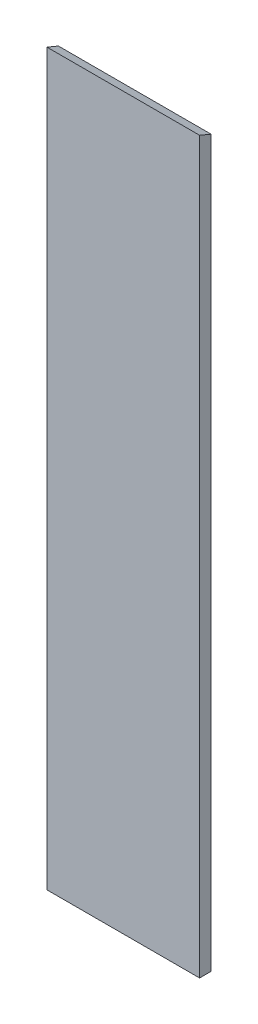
ISO-10303-21;
HEADER;
FILE_DESCRIPTION(('STEP AP214'),'2;1');
FILE_NAME('part.step','',(''),(''),'','','');
FILE_SCHEMA(('AUTOMOTIVE_DESIGN { 1 0 10303 214 1 1 1 1 }'));
ENDSEC;
DATA;
#1=APPLICATION_CONTEXT('core data for automotive mechanical design processes');
#2=APPLICATION_PROTOCOL_DEFINITION('international standard','automotive_design',2000,#1);
#3=PRODUCT_CONTEXT('',#1,'mechanical');
#4=PRODUCT('Part','Part','',(#3));
#5=PRODUCT_RELATED_PRODUCT_CATEGORY('part','',(#4));
#6=PRODUCT_DEFINITION_FORMATION('','',#4);
#7=PRODUCT_DEFINITION_CONTEXT('part definition',#1,'design');
#8=PRODUCT_DEFINITION('design','',#6,#7);
#9=PRODUCT_DEFINITION_SHAPE('','',#8);
#10=(LENGTH_UNIT() NAMED_UNIT(*) SI_UNIT(.MILLI.,.METRE.));
#11=(NAMED_UNIT(*) PLANE_ANGLE_UNIT() SI_UNIT($,.RADIAN.));
#12=(NAMED_UNIT(*) SI_UNIT($,.STERADIAN.) SOLID_ANGLE_UNIT());
#13=UNCERTAINTY_MEASURE_WITH_UNIT(LENGTH_MEASURE(1.E-05),#10,'distance_accuracy_value','');
#14=(GEOMETRIC_REPRESENTATION_CONTEXT(3) GLOBAL_UNCERTAINTY_ASSIGNED_CONTEXT((#13)) GLOBAL_UNIT_ASSIGNED_CONTEXT((#10,
#11,#12)) REPRESENTATION_CONTEXT('',''));
#15=CARTESIAN_POINT('',(0.,0.,0.));
#16=DIRECTION('',(0.,0.,1.));
#17=DIRECTION('',(1.,0.,0.));
#18=AXIS2_PLACEMENT_3D('',#15,#16,#17);
#19=CARTESIAN_POINT('',(100.,-478.1,15.));
#20=DIRECTION('',(-1.,0.,0.));
#21=DIRECTION('',(0.,0.,1.));
#22=AXIS2_PLACEMENT_3D('',#19,#20,#21);
#23=PLANE('',#22);
#24=DIRECTION('',(0.,1.,0.));
#25=VECTOR('',#24,1.);
#26=CARTESIAN_POINT('',(100.,-478.1,0.));
#27=LINE('',#26,#25);
#28=CARTESIAN_POINT('',(100.,-478.1,0.));
#29=VERTEX_POINT('',#28);
#30=CARTESIAN_POINT('',(100.,471.886796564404,0.));
#31=VERTEX_POINT('',#30);
#32=EDGE_CURVE('E82',#29,#31,#27,.T.);
#33=ORIENTED_EDGE('',*,*,#32,.T.);
#34=DIRECTION('',(0.,-0.382683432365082,-0.92387953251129));
#35=VECTOR('',#34,1.);
#36=CARTESIAN_POINT('',(100.,478.1,15.));
#37=LINE('',#36,#35);
#38=CARTESIAN_POINT('',(100.,478.1,15.));
#39=VERTEX_POINT('',#38);
#40=EDGE_CURVE('E48',#39,#31,#37,.T.);
#41=ORIENTED_EDGE('',*,*,#40,.F.);
#42=DIRECTION('',(0.,1.,0.));
#43=VECTOR('',#42,1.);
#44=CARTESIAN_POINT('',(100.,-478.1,15.));
#45=LINE('',#44,#43);
#46=CARTESIAN_POINT('',(100.,-478.1,15.));
#47=VERTEX_POINT('',#46);
#48=EDGE_CURVE('E77',#47,#39,#45,.T.);
#49=ORIENTED_EDGE('',*,*,#48,.F.);
#50=DIRECTION('',(0.,0.,-1.));
#51=VECTOR('',#50,1.);
#52=CARTESIAN_POINT('',(100.,-478.1,15.));
#53=LINE('',#52,#51);
#54=EDGE_CURVE('E41',#47,#29,#53,.T.);
#55=ORIENTED_EDGE('',*,*,#54,.T.);
#56=EDGE_LOOP('',(#33,#41,#49,#55));
#57=FACE_BOUND('',#56,.T.);
#58=ADVANCED_FACE('F34',(#57),#23,.F.);
#59=CARTESIAN_POINT('',(-100.,-478.1,15.));
#60=DIRECTION('',(1.,0.,0.));
#61=DIRECTION('',(0.,0.,-1.));
#62=AXIS2_PLACEMENT_3D('',#59,#60,#61);
#63=PLANE('',#62);
#64=DIRECTION('',(0.,-1.,0.));
#65=VECTOR('',#64,1.);
#66=CARTESIAN_POINT('',(-100.,-478.1,15.));
#67=LINE('',#66,#65);
#68=CARTESIAN_POINT('',(-100.,478.1,15.));
#69=VERTEX_POINT('',#68);
#70=CARTESIAN_POINT('',(-100.,-478.1,15.));
#71=VERTEX_POINT('',#70);
#72=EDGE_CURVE('E91',#69,#71,#67,.T.);
#73=ORIENTED_EDGE('',*,*,#72,.F.);
#74=DIRECTION('',(0.,-0.382683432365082,-0.92387953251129));
#75=VECTOR('',#74,1.);
#76=CARTESIAN_POINT('',(-100.,478.1,15.));
#77=LINE('',#76,#75);
#78=CARTESIAN_POINT('',(-100.,471.886796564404,0.));
#79=VERTEX_POINT('',#78);
#80=EDGE_CURVE('E87',#69,#79,#77,.T.);
#81=ORIENTED_EDGE('',*,*,#80,.T.);
#82=DIRECTION('',(0.,-1.,0.));
#83=VECTOR('',#82,1.);
#84=CARTESIAN_POINT('',(-100.,-478.1,0.));
#85=LINE('',#84,#83);
#86=CARTESIAN_POINT('',(-100.,-478.1,0.));
#87=VERTEX_POINT('',#86);
#88=EDGE_CURVE('E78',#79,#87,#85,.T.);
#89=ORIENTED_EDGE('',*,*,#88,.T.);
#90=DIRECTION('',(0.,0.,-1.));
#91=VECTOR('',#90,1.);
#92=CARTESIAN_POINT('',(-100.,-478.1,15.));
#93=LINE('',#92,#91);
#94=EDGE_CURVE('E11',#71,#87,#93,.T.);
#95=ORIENTED_EDGE('',*,*,#94,.F.);
#96=EDGE_LOOP('',(#73,#81,#89,#95));
#97=FACE_BOUND('',#96,.T.);
#98=ADVANCED_FACE('F102',(#97),#63,.F.);
#99=CARTESIAN_POINT('',(-100.,-478.1,15.));
#100=DIRECTION('',(0.,1.,0.));
#101=DIRECTION('',(0.,0.,1.));
#102=AXIS2_PLACEMENT_3D('',#99,#100,#101);
#103=PLANE('',#102);
#104=DIRECTION('',(1.,0.,0.));
#105=VECTOR('',#104,1.);
#106=CARTESIAN_POINT('',(-100.,-478.1,0.));
#107=LINE('',#106,#105);
#108=EDGE_CURVE('E69',#87,#29,#107,.T.);
#109=ORIENTED_EDGE('',*,*,#108,.T.);
#110=ORIENTED_EDGE('',*,*,#54,.F.);
#111=DIRECTION('',(1.,0.,0.));
#112=VECTOR('',#111,1.);
#113=CARTESIAN_POINT('',(-100.,-478.1,15.));
#114=LINE('',#113,#112);
#115=EDGE_CURVE('E57',#71,#47,#114,.T.);
#116=ORIENTED_EDGE('',*,*,#115,.F.);
#117=ORIENTED_EDGE('',*,*,#94,.T.);
#118=EDGE_LOOP('',(#109,#110,#116,#117));
#119=FACE_BOUND('',#118,.T.);
#120=ADVANCED_FACE('F71',(#119),#103,.F.);
#121=CARTESIAN_POINT('',(0.,0.,15.));
#122=DIRECTION('',(0.,0.,-1.));
#123=DIRECTION('',(-1.,0.,0.));
#124=AXIS2_PLACEMENT_3D('',#121,#122,#123);
#125=PLANE('',#124);
#126=ORIENTED_EDGE('',*,*,#48,.T.);
#127=DIRECTION('',(-1.,0.,0.));
#128=VECTOR('',#127,1.);
#129=CARTESIAN_POINT('',(-100.,478.1,15.));
#130=LINE('',#129,#128);
#131=EDGE_CURVE('E93',#39,#69,#130,.T.);
#132=ORIENTED_EDGE('',*,*,#131,.T.);
#133=ORIENTED_EDGE('',*,*,#72,.T.);
#134=ORIENTED_EDGE('',*,*,#115,.T.);
#135=EDGE_LOOP('',(#126,#132,#133,#134));
#136=FACE_BOUND('',#135,.T.);
#137=ADVANCED_FACE('F108',(#136),#125,.F.);
#138=CARTESIAN_POINT('',(0.,0.,0.));
#139=DIRECTION('',(0.,0.,-1.));
#140=DIRECTION('',(-1.,0.,0.));
#141=AXIS2_PLACEMENT_3D('',#138,#139,#140);
#142=PLANE('',#141);
#143=DIRECTION('',(1.,0.,0.));
#144=VECTOR('',#143,1.);
#145=CARTESIAN_POINT('',(-100.,471.886796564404,0.));
#146=LINE('',#145,#144);
#147=EDGE_CURVE('E84',#79,#31,#146,.T.);
#148=ORIENTED_EDGE('',*,*,#147,.T.);
#149=ORIENTED_EDGE('',*,*,#32,.F.);
#150=ORIENTED_EDGE('',*,*,#108,.F.);
#151=ORIENTED_EDGE('',*,*,#88,.F.);
#152=EDGE_LOOP('',(#148,#149,#150,#151));
#153=FACE_BOUND('',#152,.T.);
#154=ADVANCED_FACE('F83',(#153),#142,.T.);
#155=CARTESIAN_POINT('',(-100.,478.1,15.));
#156=DIRECTION('',(0.,-0.92387953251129,0.382683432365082));
#157=DIRECTION('',(0.,-0.382683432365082,-0.92387953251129));
#158=AXIS2_PLACEMENT_3D('',#155,#156,#157);
#159=PLANE('',#158);
#160=ORIENTED_EDGE('',*,*,#40,.T.);
#161=ORIENTED_EDGE('',*,*,#147,.F.);
#162=ORIENTED_EDGE('',*,*,#80,.F.);
#163=ORIENTED_EDGE('',*,*,#131,.F.);
#164=EDGE_LOOP('',(#160,#161,#162,#163));
#165=FACE_BOUND('',#164,.T.);
#166=ADVANCED_FACE('F105',(#165),#159,.F.);
#167=CLOSED_SHELL('',(#58,#98,#120,#137,#154,#166));
#168=MANIFOLD_SOLID_BREP('B2',#167);
#169=ADVANCED_BREP_SHAPE_REPRESENTATION('',(#18,#168),#14);
#170=SHAPE_DEFINITION_REPRESENTATION(#9,#169);
ENDSEC;
END-ISO-10303-21;
